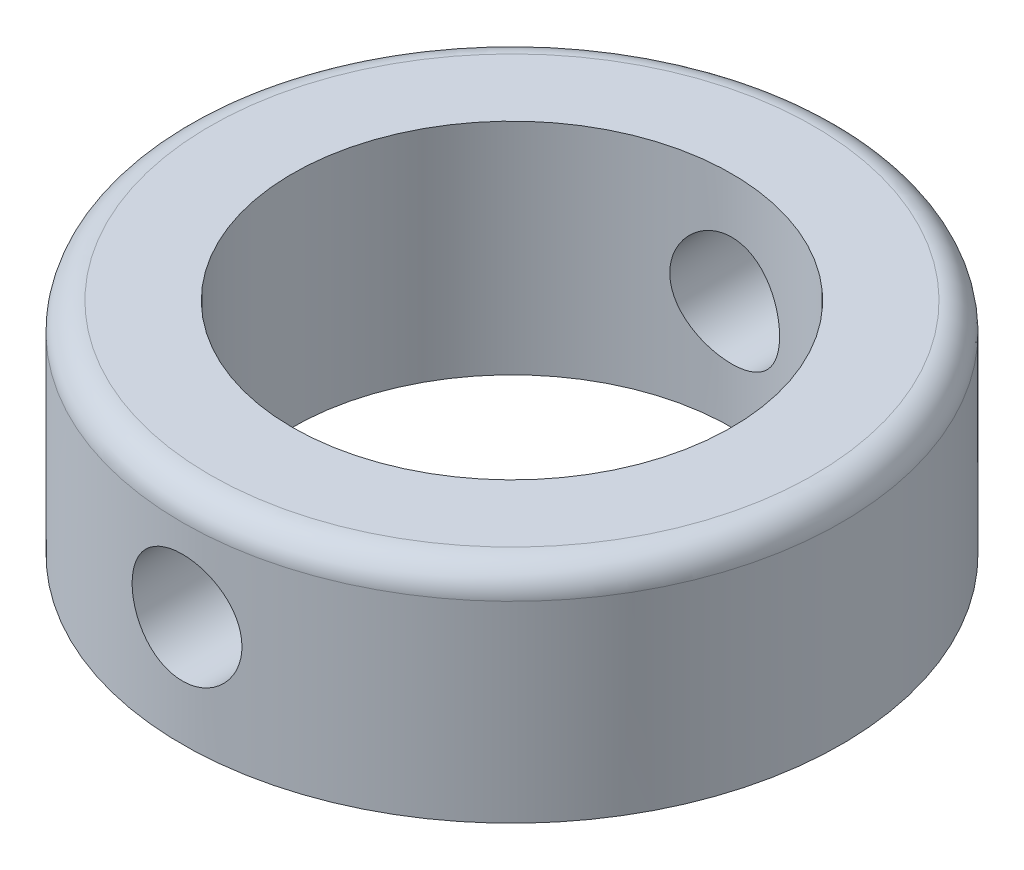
ISO-10303-21;
HEADER;
FILE_DESCRIPTION(('STEP AP214'),'2;1');
FILE_NAME('part.step','',(''),(''),'','','');
FILE_SCHEMA(('AUTOMOTIVE_DESIGN { 1 0 10303 214 1 1 1 1 }'));
ENDSEC;
DATA;
#1=APPLICATION_CONTEXT('core data for automotive mechanical design processes');
#2=APPLICATION_PROTOCOL_DEFINITION('international standard','automotive_design',2000,#1);
#3=PRODUCT_CONTEXT('',#1,'mechanical');
#4=PRODUCT('Part','Part','',(#3));
#5=PRODUCT_RELATED_PRODUCT_CATEGORY('part','',(#4));
#6=PRODUCT_DEFINITION_FORMATION('','',#4);
#7=PRODUCT_DEFINITION_CONTEXT('part definition',#1,'design');
#8=PRODUCT_DEFINITION('design','',#6,#7);
#9=PRODUCT_DEFINITION_SHAPE('','',#8);
#10=(LENGTH_UNIT() NAMED_UNIT(*) SI_UNIT(.MILLI.,.METRE.));
#11=(NAMED_UNIT(*) PLANE_ANGLE_UNIT() SI_UNIT($,.RADIAN.));
#12=(NAMED_UNIT(*) SI_UNIT($,.STERADIAN.) SOLID_ANGLE_UNIT());
#13=UNCERTAINTY_MEASURE_WITH_UNIT(LENGTH_MEASURE(1.E-05),#10,'distance_accuracy_value','');
#14=(GEOMETRIC_REPRESENTATION_CONTEXT(3) GLOBAL_UNCERTAINTY_ASSIGNED_CONTEXT((#13)) GLOBAL_UNIT_ASSIGNED_CONTEXT((#10,
#11,#12)) REPRESENTATION_CONTEXT('',''));
#15=CARTESIAN_POINT('',(0.,0.,0.));
#16=DIRECTION('',(0.,0.,1.));
#17=DIRECTION('',(1.,0.,0.));
#18=AXIS2_PLACEMENT_3D('',#15,#16,#17);
#19=CARTESIAN_POINT('',(-2.41516970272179E-06,5.98419674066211,0.));
#20=DIRECTION('',(0.,-1.,0.));
#21=DIRECTION('',(0.,0.,-1.));
#22=AXIS2_PLACEMENT_3D('',#19,#20,#21);
#23=CYLINDRICAL_SURFACE('',#22,6.);
#24=CARTESIAN_POINT('',(-2.41516970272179E-06,5.48284036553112,0.));
#25=DIRECTION('',(0.,1.,0.));
#26=DIRECTION('',(0.,0.,1.));
#27=AXIS2_PLACEMENT_3D('',#24,#25,#26);
#28=CIRCLE('',#27,6.);
#29=CARTESIAN_POINT('',(-2.41516970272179E-06,5.48284036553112,6.));
#30=VERTEX_POINT('',#29);
#31=EDGE_CURVE('E38',#30,#30,#28,.F.);
#32=ORIENTED_EDGE('',*,*,#31,.T.);
#33=EDGE_LOOP('',(#32));
#34=FACE_BOUND('',#33,.T.);
#35=CARTESIAN_POINT('',(-2.41516970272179E-06,4.9841717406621,-6.));
#36=CARTESIAN_POINT('',(0.0557539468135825,4.98416950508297,-5.99999904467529));
#37=CARTESIAN_POINT('',(0.111540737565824,4.97949283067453,-5.99921471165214));
#38=CARTESIAN_POINT('',(0.221549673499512,4.96091747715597,-5.99616137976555));
#39=CARTESIAN_POINT('',(0.275770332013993,4.94701031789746,-5.99389101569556));
#40=CARTESIAN_POINT('',(0.38103948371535,4.910405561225,-5.9881202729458));
#41=CARTESIAN_POINT('',(0.432090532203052,4.88771515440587,-5.98462090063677));
#42=CARTESIAN_POINT('',(0.529654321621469,4.83420682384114,-5.97677690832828));
#43=CARTESIAN_POINT('',(0.576167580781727,4.8033898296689,-5.97243238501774));
#44=CARTESIAN_POINT('',(0.663786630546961,4.73418970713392,-5.96333326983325));
#45=CARTESIAN_POINT('',(0.704842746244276,4.69574409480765,-5.95857548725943));
#46=CARTESIAN_POINT('',(0.779952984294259,4.61251255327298,-5.94921050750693));
#47=CARTESIAN_POINT('',(0.814006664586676,4.56772622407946,-5.94460331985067));
#48=CARTESIAN_POINT('',(0.87434443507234,4.47274335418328,-5.93603026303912));
#49=CARTESIAN_POINT('',(0.900579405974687,4.4225152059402,-5.93206851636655));
#50=CARTESIAN_POINT('',(0.944220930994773,4.31828791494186,-5.9252791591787));
#51=CARTESIAN_POINT('',(0.961628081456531,4.26428902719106,-5.92245147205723));
#52=CARTESIAN_POINT('',(0.986963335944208,4.15457963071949,-5.91828214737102));
#53=CARTESIAN_POINT('',(0.994977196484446,4.09888944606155,-5.9169270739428));
#54=CARTESIAN_POINT('',(1.00156427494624,3.98693962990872,-5.9158157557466));
#55=CARTESIAN_POINT('',(1.00013816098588,3.93068003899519,-5.91605939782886));
#56=CARTESIAN_POINT('',(0.987955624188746,3.81980059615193,-5.91810571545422));
#57=CARTESIAN_POINT('',(0.977295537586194,3.76516981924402,-5.91989229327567));
#58=CARTESIAN_POINT('',(0.947098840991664,3.65848321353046,-5.92479798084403));
#59=CARTESIAN_POINT('',(0.927561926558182,3.6064274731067,-5.92791713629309));
#60=CARTESIAN_POINT('',(0.880068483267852,3.50608021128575,-5.9351539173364));
#61=CARTESIAN_POINT('',(0.852071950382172,3.45780797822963,-5.9392762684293));
#62=CARTESIAN_POINT('',(0.788482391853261,3.36660998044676,-5.94805167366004));
#63=CARTESIAN_POINT('',(0.752888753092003,3.32368464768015,-5.95270477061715));
#64=CARTESIAN_POINT('',(0.67459046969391,3.24384130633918,-5.96208811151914));
#65=CARTESIAN_POINT('',(0.63180317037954,3.20700433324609,-5.96681859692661));
#66=CARTESIAN_POINT('',(0.540611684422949,3.14102063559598,-5.97577040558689));
#67=CARTESIAN_POINT('',(0.49220746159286,3.11187396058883,-5.97999172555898));
#68=CARTESIAN_POINT('',(0.391079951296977,3.06209084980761,-5.98745557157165));
#69=CARTESIAN_POINT('',(0.338353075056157,3.04146157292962,-5.99069727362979));
#70=CARTESIAN_POINT('',(0.230116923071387,3.00937405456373,-5.99583001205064));
#71=CARTESIAN_POINT('',(0.174607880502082,2.99791504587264,-5.9977211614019));
#72=CARTESIAN_POINT('',(0.0630815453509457,2.98460319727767,-5.99992451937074));
#73=CARTESIAN_POINT('',(0.00707787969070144,2.98263911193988,-6.00025501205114));
#74=CARTESIAN_POINT('',(-0.104458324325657,2.98807627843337,-5.99934989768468));
#75=CARTESIAN_POINT('',(-0.159990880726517,2.99547716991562,-5.99811435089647));
#76=CARTESIAN_POINT('',(-0.268664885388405,3.01934168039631,-5.99422730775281));
#77=CARTESIAN_POINT('',(-0.321818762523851,3.03575022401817,-5.99158441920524));
#78=CARTESIAN_POINT('',(-0.424621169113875,3.07710554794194,-5.98517785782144));
#79=CARTESIAN_POINT('',(-0.474269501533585,3.10205280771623,-5.98141412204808));
#80=CARTESIAN_POINT('',(-0.569134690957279,3.16003219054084,-5.97313806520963));
#81=CARTESIAN_POINT('',(-0.614308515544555,3.19313380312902,-5.96861942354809));
#82=CARTESIAN_POINT('',(-0.69849984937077,3.26638666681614,-5.9593538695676));
#83=CARTESIAN_POINT('',(-0.737516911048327,3.30653842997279,-5.95460694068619));
#84=CARTESIAN_POINT('',(-0.808699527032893,3.39325075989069,-5.94536070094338));
#85=CARTESIAN_POINT('',(-0.840789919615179,3.43987340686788,-5.94086446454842));
#86=CARTESIAN_POINT('',(-0.896683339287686,3.53791292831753,-5.93268611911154));
#87=CARTESIAN_POINT('',(-0.920486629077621,3.58932965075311,-5.92900398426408));
#88=CARTESIAN_POINT('',(-0.959017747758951,3.69528763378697,-5.92289381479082));
#89=CARTESIAN_POINT('',(-0.973782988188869,3.74981497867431,-5.92046061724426));
#90=CARTESIAN_POINT('',(-0.993936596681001,3.86061979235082,-5.91711086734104));
#91=CARTESIAN_POINT('',(-0.999325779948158,3.91689710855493,-5.91619418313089));
#92=CARTESIAN_POINT('',(-1.00055156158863,4.02885380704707,-5.91598693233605));
#93=CARTESIAN_POINT('',(-0.996506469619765,4.08453189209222,-5.9166762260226));
#94=CARTESIAN_POINT('',(-0.97923435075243,4.19440343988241,-5.91955912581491));
#95=CARTESIAN_POINT('',(-0.966007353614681,4.24859690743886,-5.92175272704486));
#96=CARTESIAN_POINT('',(-0.930792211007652,4.35391511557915,-5.92738942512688));
#97=CARTESIAN_POINT('',(-0.908814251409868,4.40504334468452,-5.93083106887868));
#98=CARTESIAN_POINT('',(-0.856733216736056,4.50290600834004,-5.93857747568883));
#99=CARTESIAN_POINT('',(-0.826629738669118,4.54964022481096,-5.9428822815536));
#100=CARTESIAN_POINT('',(-0.758729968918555,4.6379859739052,-5.95193381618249));
#101=CARTESIAN_POINT('',(-0.720846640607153,4.67953014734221,-5.95668518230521));
#102=CARTESIAN_POINT('',(-0.638646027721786,4.75571238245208,-5.96605748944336));
#103=CARTESIAN_POINT('',(-0.594327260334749,4.79034884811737,-5.97067840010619));
#104=CARTESIAN_POINT('',(-0.500150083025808,4.85195104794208,-5.97930611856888));
#105=CARTESIAN_POINT('',(-0.450255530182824,4.87886215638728,-5.98330846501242));
#106=CARTESIAN_POINT('',(-0.34660764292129,4.92387953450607,-5.9902046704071));
#107=CARTESIAN_POINT('',(-0.292858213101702,4.94199457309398,-5.99309963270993));
#108=CARTESIAN_POINT('',(-0.19908373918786,4.96497385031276,-5.99682316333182));
#109=CARTESIAN_POINT('',(-0.159625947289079,4.97216152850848,-5.99800810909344));
#110=CARTESIAN_POINT('',(-0.0801181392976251,4.9817612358,-5.99959686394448));
#111=CARTESIAN_POINT('',(-0.0400681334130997,4.98417334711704,-6.00000068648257));
#112=CARTESIAN_POINT('',(-2.41516970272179E-06,4.9841717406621,-6.));
#113=B_SPLINE_CURVE_WITH_KNOTS('',3,(#35,#36,#37,#38,#39,#40,#41,#42,#43,#44,#45,#46,#47,#48,
#49,#50,#51,#52,#53,#54,#55,#56,#57,#58,#59,#60,#61,#62,#63,#64,#65,#66,#67,#68,#69,#70,#71,#72,
#73,#74,#75,#76,#77,#78,#79,#80,#81,#82,#83,#84,#85,#86,#87,#88,#89,#90,#91,#92,#93,#94,#95,#96,
#97,#98,#99,#100,#101,#102,#103,#104,#105,#106,#107,#108,#109,#110,#111,#112),.UNSPECIFIED.,.T.,
.F.,(4,2,2,2,2,2,2,2,2,2,2,2,2,2,2,2,2,2,2,2,2,2,2,2,2,2,2,2,2,2,2,2,2,2,2,2,2,2,4),(0.,
0.167122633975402,0.334399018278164,0.501538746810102,0.668659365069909,0.837209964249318,
1.00577120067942,1.17537008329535,1.34495750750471,1.51298430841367,1.68099921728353,
1.84728208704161,2.0135706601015,2.1806582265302,2.34775928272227,2.51693107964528,
2.68610396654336,2.85541875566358,3.02471937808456,3.19203153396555,3.3593372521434,
3.52563122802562,3.69193454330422,3.85970730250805,4.02749225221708,4.19701528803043,
4.36653294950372,4.53534408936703,4.70414055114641,4.87083163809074,5.03752218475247,
5.20401927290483,5.37052462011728,5.5390055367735,5.70752533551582,5.87720892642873,
6.04672300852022,6.166816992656,6.28690890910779),.UNSPECIFIED.);
#114=CARTESIAN_POINT('',(-2.41516970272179E-06,4.9841717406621,-6.));
#115=VERTEX_POINT('',#114);
#116=EDGE_CURVE('E49',#115,#115,#113,.T.);
#117=ORIENTED_EDGE('',*,*,#116,.F.);
#118=EDGE_LOOP('',(#117));
#119=FACE_BOUND('',#118,.T.);
#120=CARTESIAN_POINT('',(0.999997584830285,3.98417174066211,5.91607978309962));
#121=CARTESIAN_POINT('',(0.999995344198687,4.03992203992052,5.91608078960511));
#122=CARTESIAN_POINT('',(0.995319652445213,4.09570278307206,5.91687637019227));
#123=CARTESIAN_POINT('',(0.976748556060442,4.20569915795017,5.91996982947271));
#124=CARTESIAN_POINT('',(0.962844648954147,4.25991329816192,5.92226909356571));
#125=CARTESIAN_POINT('',(0.926249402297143,4.36516865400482,5.9281024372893));
#126=CARTESIAN_POINT('',(0.903565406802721,4.41621248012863,5.9316354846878));
#127=CARTESIAN_POINT('',(0.850072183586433,4.51376412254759,5.93953708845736));
#128=CARTESIAN_POINT('',(0.819263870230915,4.5602724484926,5.94390555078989));
#129=CARTESIAN_POINT('',(0.750072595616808,4.64789688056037,5.95303388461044));
#130=CARTESIAN_POINT('',(0.711625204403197,4.68896179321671,5.95779686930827));
#131=CARTESIAN_POINT('',(0.628386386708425,4.76408906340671,5.96714992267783));
#132=CARTESIAN_POINT('',(0.583594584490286,4.79815100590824,5.97173998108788));
#133=CARTESIAN_POINT('',(0.488606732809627,4.85849756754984,5.98026294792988));
#134=CARTESIAN_POINT('',(0.438380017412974,4.88473454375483,5.98419176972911));
#135=CARTESIAN_POINT('',(0.334155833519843,4.92838016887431,5.99091494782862));
#136=CARTESIAN_POINT('',(0.28015861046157,4.94578939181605,5.9937093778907));
#137=CARTESIAN_POINT('',(0.170455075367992,4.97112875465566,5.99782693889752));
#138=CARTESIAN_POINT('',(0.114769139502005,4.97914490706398,5.99916341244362));
#139=CARTESIAN_POINT('',(0.00282769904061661,4.98573804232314,6.00026031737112));
#140=CARTESIAN_POINT('',(-0.0534277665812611,4.98431566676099,6.00002085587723));
#141=CARTESIAN_POINT('',(-0.164323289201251,4.97213920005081,5.99800343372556));
#142=CARTESIAN_POINT('',(-0.218973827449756,4.96147767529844,5.99624073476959));
#143=CARTESIAN_POINT('',(-0.325699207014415,4.9312713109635,5.99139191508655));
#144=CARTESIAN_POINT('',(-0.377773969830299,4.9117262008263,5.98830575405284));
#145=CARTESIAN_POINT('',(-0.478144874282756,4.86421548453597,5.98113079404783));
#146=CARTESIAN_POINT('',(-0.526422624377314,4.83621173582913,5.97703746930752));
#147=CARTESIAN_POINT('',(-0.617628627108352,4.77260661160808,5.96830295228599));
#148=CARTESIAN_POINT('',(-0.660556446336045,4.73700462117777,5.96366171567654));
#149=CARTESIAN_POINT('',(-0.74039092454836,4.65870021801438,5.95428107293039));
#150=CARTESIAN_POINT('',(-0.777218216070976,4.61591690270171,5.94954115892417));
#151=CARTESIAN_POINT('',(-0.843184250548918,4.52473690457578,5.94055183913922));
#152=CARTESIAN_POINT('',(-0.872322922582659,4.47634016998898,5.9363024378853));
#153=CARTESIAN_POINT('',(-0.922100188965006,4.37521508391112,5.92877501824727));
#154=CARTESIAN_POINT('',(-0.942729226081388,4.32248194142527,5.92549809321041));
#155=CARTESIAN_POINT('',(-0.974814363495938,4.21423211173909,5.92030475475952));
#156=CARTESIAN_POINT('',(-0.986271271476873,4.15871567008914,5.91838822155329));
#157=CARTESIAN_POINT('',(-0.999575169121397,4.04718527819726,5.91615583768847));
#158=CARTESIAN_POINT('',(-1.00153529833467,3.99118518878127,5.91582114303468));
#159=CARTESIAN_POINT('',(-0.996091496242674,3.87965707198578,5.91674013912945));
#160=CARTESIAN_POINT('',(-0.988687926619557,3.82412902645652,5.91799376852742));
#161=CARTESIAN_POINT('',(-0.96482334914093,3.71548063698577,5.92193074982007));
#162=CARTESIAN_POINT('',(-0.948419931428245,3.66234728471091,5.92460500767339));
#163=CARTESIAN_POINT('',(-0.907081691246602,3.55958367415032,5.93107429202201));
#164=CARTESIAN_POINT('',(-0.882146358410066,3.50995362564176,5.93486938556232));
#165=CARTESIAN_POINT('',(-0.824185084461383,3.41510190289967,5.94319651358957));
#166=CARTESIAN_POINT('',(-0.791086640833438,3.36992511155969,5.94773502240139));
#167=CARTESIAN_POINT('',(-0.717838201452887,3.28572632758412,5.95701866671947));
#168=CARTESIAN_POINT('',(-0.677687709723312,3.24670476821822,5.96176381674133));
#169=CARTESIAN_POINT('',(-0.590973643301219,3.17551098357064,5.97098568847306));
#170=CARTESIAN_POINT('',(-0.544347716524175,3.1434142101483,5.97545910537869));
#171=CARTESIAN_POINT('',(-0.446299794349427,3.08750960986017,5.98358044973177));
#172=CARTESIAN_POINT('',(-0.394877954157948,3.06370151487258,5.9872284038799));
#173=CARTESIAN_POINT('',(-0.28892203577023,3.02516750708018,5.99327343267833));
#174=CARTESIAN_POINT('',(-0.234402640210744,3.01040211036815,5.99567593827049));
#175=CARTESIAN_POINT('',(-0.123614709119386,2.99024550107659,5.99898233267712));
#176=CARTESIAN_POINT('',(-0.0673463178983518,2.98485351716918,5.99988634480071));
#177=CARTESIAN_POINT('',(0.044614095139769,2.98361898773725,6.0000921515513));
#178=CARTESIAN_POINT('',(0.100304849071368,2.9876616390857,5.99941320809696));
#179=CARTESIAN_POINT('',(0.210202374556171,3.00493330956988,5.99656871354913));
#180=CARTESIAN_POINT('',(0.264409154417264,3.01816227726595,5.99440317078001));
#181=CARTESIAN_POINT('',(0.369756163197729,3.05338700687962,5.98882795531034));
#182=CARTESIAN_POINT('',(0.420899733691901,3.0753730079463,5.98541966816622));
#183=CARTESIAN_POINT('',(0.518789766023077,3.12747491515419,5.97773102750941));
#184=CARTESIAN_POINT('',(0.565536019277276,3.15759120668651,5.97345063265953));
#185=CARTESIAN_POINT('',(0.653882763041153,3.22550577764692,5.96443051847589));
#186=CARTESIAN_POINT('',(0.695418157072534,3.26338812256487,5.95968609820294));
#187=CARTESIAN_POINT('',(0.771583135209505,3.3455830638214,5.95030521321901));
#188=CARTESIAN_POINT('',(0.806211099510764,3.38989716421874,5.94566877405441));
#189=CARTESIAN_POINT('',(0.867803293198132,3.48406986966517,5.93699337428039));
#190=CARTESIAN_POINT('',(0.894711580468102,3.53396547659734,5.93295887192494));
#191=CARTESIAN_POINT('',(0.93972339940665,3.63761543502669,5.92599684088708));
#192=CARTESIAN_POINT('',(0.957835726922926,3.69136586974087,5.92306820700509));
#193=CARTESIAN_POINT('',(0.980808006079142,3.78513324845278,5.91929897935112));
#194=CARTESIAN_POINT('',(0.987992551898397,3.82458246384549,5.91809849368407));
#195=CARTESIAN_POINT('',(0.997588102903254,3.90407313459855,5.91648854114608));
#196=CARTESIAN_POINT('',(0.999999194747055,3.94411457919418,5.91607905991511));
#197=CARTESIAN_POINT('',(0.999997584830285,3.98417174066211,5.91607978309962));
#198=B_SPLINE_CURVE_WITH_KNOTS('',3,(#120,#121,#122,#123,#124,#125,#126,#127,#128,#129,#130,
#131,#132,#133,#134,#135,#136,#137,#138,#139,#140,#141,#142,#143,#144,#145,#146,#147,#148,#149,
#150,#151,#152,#153,#154,#155,#156,#157,#158,#159,#160,#161,#162,#163,#164,#165,#166,#167,#168,
#169,#170,#171,#172,#173,#174,#175,#176,#177,#178,#179,#180,#181,#182,#183,#184,#185,#186,#187,
#188,#189,#190,#191,#192,#193,#194,#195,#196,#197),.UNSPECIFIED.,.T.,.F.,(4,2,2,2,2,2,2,2,2,2,2,
2,2,2,2,2,2,2,2,2,2,2,2,2,2,2,2,2,2,2,2,2,2,2,2,2,2,2,4),(0.,0.167104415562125,
0.334363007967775,0.50148199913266,0.668582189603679,0.83715663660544,1.00574107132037,
1.17533192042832,1.34491174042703,1.51292626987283,1.68092937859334,1.84726848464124,
2.0136126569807,2.18071841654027,2.34783770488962,2.51698449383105,2.68613284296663,
2.85547064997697,3.02479354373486,3.1920941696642,3.35938833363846,3.52562425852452,
3.69187012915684,3.85964937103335,4.0274404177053,4.19697645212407,4.36650700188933,
4.53529193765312,4.70406298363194,4.8707911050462,5.03751829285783,5.20406015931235,
5.37060992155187,5.53906798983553,5.70756551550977,5.87725491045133,6.04677426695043,
6.16684268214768,6.28690891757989),.UNSPECIFIED.);
#199=CARTESIAN_POINT('',(0.999997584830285,3.98417174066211,5.91607978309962));
#200=VERTEX_POINT('',#199);
#201=EDGE_CURVE('E57',#200,#200,#198,.T.);
#202=ORIENTED_EDGE('',*,*,#201,.F.);
#203=EDGE_LOOP('',(#202));
#204=FACE_BOUND('',#203,.T.);
#205=CARTESIAN_POINT('',(-2.41516970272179E-06,1.98417174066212,0.));
#206=DIRECTION('',(0.,-1.,0.));
#207=DIRECTION('',(0.,0.,-1.));
#208=AXIS2_PLACEMENT_3D('',#205,#206,#207);
#209=CIRCLE('',#208,6.);
#210=CARTESIAN_POINT('',(-2.41516970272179E-06,1.98417174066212,-6.));
#211=VERTEX_POINT('',#210);
#212=EDGE_CURVE('E42',#211,#211,#209,.T.);
#213=ORIENTED_EDGE('',*,*,#212,.F.);
#214=EDGE_LOOP('',(#213));
#215=FACE_BOUND('',#214,.T.);
#216=ADVANCED_FACE('F31',(#34,#119,#204,#215),#23,.T.);
#217=CARTESIAN_POINT('',(5.9999975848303,5.98417174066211,0.));
#218=DIRECTION('',(0.,1.,0.));
#219=DIRECTION('',(0.,0.,1.));
#220=AXIS2_PLACEMENT_3D('',#217,#218,#219);
#221=PLANE('',#220);
#222=CARTESIAN_POINT('',(-2.41516970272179E-06,5.98417174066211,0.));
#223=DIRECTION('',(0.,1.,0.));
#224=DIRECTION('',(0.,0.,1.));
#225=AXIS2_PLACEMENT_3D('',#222,#223,#224);
#226=CIRCLE('',#225,5.49866862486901);
#227=CARTESIAN_POINT('',(-2.41516970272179E-06,5.98417174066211,5.49866862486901));
#228=VERTEX_POINT('',#227);
#229=EDGE_CURVE('E10',#228,#228,#226,.T.);
#230=ORIENTED_EDGE('',*,*,#229,.T.);
#231=EDGE_LOOP('',(#230));
#232=FACE_BOUND('',#231,.T.);
#233=CARTESIAN_POINT('',(-2.41516970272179E-06,5.98417174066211,1.4656309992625E-06));
#234=DIRECTION('',(0.,1.,0.));
#235=DIRECTION('',(0.,0.,1.));
#236=AXIS2_PLACEMENT_3D('',#233,#234,#235);
#237=CIRCLE('',#236,3.99999999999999);
#238=CARTESIAN_POINT('',(-2.41516970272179E-06,5.98417174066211,4.00000146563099));
#239=VERTEX_POINT('',#238);
#240=EDGE_CURVE('E83',#239,#239,#237,.T.);
#241=ORIENTED_EDGE('',*,*,#240,.F.);
#242=EDGE_LOOP('',(#241));
#243=FACE_BOUND('',#242,.T.);
#244=ADVANCED_FACE('F97',(#232,#243),#221,.T.);
#245=CARTESIAN_POINT('',(-2.41516970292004E-06,1.98417174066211,0.));
#246=DIRECTION('',(0.,-1.,0.));
#247=DIRECTION('',(0.,0.,-1.));
#248=AXIS2_PLACEMENT_3D('',#245,#246,#247);
#249=PLANE('',#248);
#250=CARTESIAN_POINT('',(-2.41516970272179E-06,1.98417174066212,1.4656309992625E-06));
#251=DIRECTION('',(0.,1.,0.));
#252=DIRECTION('',(0.,0.,1.));
#253=AXIS2_PLACEMENT_3D('',#250,#251,#252);
#254=CIRCLE('',#253,3.99999999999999);
#255=CARTESIAN_POINT('',(-2.41516970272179E-06,1.98417174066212,4.00000146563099));
#256=VERTEX_POINT('',#255);
#257=EDGE_CURVE('E46',#256,#256,#254,.T.);
#258=ORIENTED_EDGE('',*,*,#257,.T.);
#259=EDGE_LOOP('',(#258));
#260=FACE_BOUND('',#259,.T.);
#261=ORIENTED_EDGE('',*,*,#212,.T.);
#262=EDGE_LOOP('',(#261));
#263=FACE_BOUND('',#262,.T.);
#264=ADVANCED_FACE('F89',(#260,#263),#249,.T.);
#265=CARTESIAN_POINT('',(-2.41516970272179E-06,5.98417174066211,1.4656309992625E-06));
#266=DIRECTION('',(0.,1.,0.));
#267=DIRECTION('',(0.,0.,1.));
#268=AXIS2_PLACEMENT_3D('',#265,#266,#267);
#269=CYLINDRICAL_SURFACE('',#268,3.99999999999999);
#270=CARTESIAN_POINT('',(-2.41516970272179E-06,2.98417174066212,4.00000146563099));
#271=CARTESIAN_POINT('',(0.0552483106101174,2.98417329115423,4.00000053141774));
#272=CARTESIAN_POINT('',(0.110516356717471,2.98876610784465,3.99884531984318));
#273=CARTESIAN_POINT('',(0.219468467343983,3.00698850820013,3.9943488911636));
#274=CARTESIAN_POINT('',(0.273151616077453,3.02062321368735,3.99100643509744));
#275=CARTESIAN_POINT('',(0.377344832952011,3.05646457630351,3.98250564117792));
#276=CARTESIAN_POINT('',(0.427858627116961,3.07866093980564,3.97734948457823));
#277=CARTESIAN_POINT('',(0.524445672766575,3.13095933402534,3.96577042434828));
#278=CARTESIAN_POINT('',(0.57051877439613,3.16106163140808,3.95934747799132));
#279=CARTESIAN_POINT('',(0.657865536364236,3.22897226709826,3.94578422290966));
#280=CARTESIAN_POINT('',(0.69903471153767,3.26691279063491,3.93863284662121));
#281=CARTESIAN_POINT('',(0.774496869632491,3.34913987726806,3.92449226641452));
#282=CARTESIAN_POINT('',(0.808789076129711,3.39342715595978,3.91750308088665));
#283=CARTESIAN_POINT('',(0.870015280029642,3.48790189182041,3.90436663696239));
#284=CARTESIAN_POINT('',(0.896832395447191,3.53816722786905,3.89823342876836));
#285=CARTESIAN_POINT('',(0.941595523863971,3.64267068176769,3.88766476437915));
#286=CARTESIAN_POINT('',(0.959542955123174,3.69690816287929,3.88322903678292));
#287=CARTESIAN_POINT('',(0.985700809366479,3.80666740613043,3.87667131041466));
#288=CARTESIAN_POINT('',(0.994099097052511,3.86214167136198,3.87450473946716));
#289=CARTESIAN_POINT('',(1.00150543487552,3.97375078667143,3.8725972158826));
#290=CARTESIAN_POINT('',(1.00051501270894,4.02988552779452,3.87285586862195));
#291=CARTESIAN_POINT('',(0.989321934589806,4.13978227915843,3.87572950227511));
#292=CARTESIAN_POINT('',(0.979343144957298,4.19356882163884,3.87828721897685));
#293=CARTESIAN_POINT('',(0.950813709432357,4.2986791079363,3.88537953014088));
#294=CARTESIAN_POINT('',(0.932262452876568,4.35000267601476,3.88991426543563));
#295=CARTESIAN_POINT('',(0.886923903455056,4.44933041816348,3.90050222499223));
#296=CARTESIAN_POINT('',(0.86005536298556,4.49729585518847,3.90657031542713));
#297=CARTESIAN_POINT('',(0.798901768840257,4.58811754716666,3.91953287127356));
#298=CARTESIAN_POINT('',(0.764615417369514,4.63097290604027,3.92642748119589));
#299=CARTESIAN_POINT('',(0.6884398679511,4.7116408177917,3.9405073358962));
#300=CARTESIAN_POINT('',(0.646361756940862,4.74927473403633,3.9476952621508));
#301=CARTESIAN_POINT('',(0.556405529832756,4.8169859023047,3.96137456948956));
#302=CARTESIAN_POINT('',(0.508527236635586,4.84706292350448,3.96786592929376));
#303=CARTESIAN_POINT('',(0.408074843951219,4.89887213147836,3.97945301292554));
#304=CARTESIAN_POINT('',(0.355485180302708,4.92057530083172,3.98454386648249));
#305=CARTESIAN_POINT('',(0.247248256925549,4.95478327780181,3.99272091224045));
#306=CARTESIAN_POINT('',(0.191601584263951,4.96728984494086,3.99580748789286));
#307=CARTESIAN_POINT('',(0.0803575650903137,4.98247678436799,3.99957146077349));
#308=CARTESIAN_POINT('',(0.0247953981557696,4.9854004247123,4.00030848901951));
#309=CARTESIAN_POINT('',(-0.086024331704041,4.98200573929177,3.99946016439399));
#310=CARTESIAN_POINT('',(-0.141281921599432,4.97568824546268,3.99787502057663));
#311=CARTESIAN_POINT('',(-0.249078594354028,4.95419113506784,3.9925986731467));
#312=CARTESIAN_POINT('',(-0.301645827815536,4.93914423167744,3.98893902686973));
#313=CARTESIAN_POINT('',(-0.403507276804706,4.90076701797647,3.97992617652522));
#314=CARTESIAN_POINT('',(-0.452801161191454,4.87743587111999,3.97457280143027));
#315=CARTESIAN_POINT('',(-0.547684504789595,4.82268098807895,3.96262351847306));
#316=CARTESIAN_POINT('',(-0.593192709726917,4.79112099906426,3.9560072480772));
#317=CARTESIAN_POINT('',(-0.678353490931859,4.72097846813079,3.94229819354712));
#318=CARTESIAN_POINT('',(-0.718005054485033,4.68239471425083,3.93520532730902));
#319=CARTESIAN_POINT('',(-0.791329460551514,4.59817043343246,3.92112784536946));
#320=CARTESIAN_POINT('',(-0.824831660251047,4.55237993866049,3.91415016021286));
#321=CARTESIAN_POINT('',(-0.88367625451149,4.45568331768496,3.90128732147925));
#322=CARTESIAN_POINT('',(-0.909019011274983,4.40477741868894,3.89540211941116));
#323=CARTESIAN_POINT('',(-0.950636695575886,4.29956792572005,3.88545543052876));
#324=CARTESIAN_POINT('',(-0.966965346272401,4.24528665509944,3.88138316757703));
#325=CARTESIAN_POINT('',(-0.990232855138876,4.13463198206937,3.87551309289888));
#326=CARTESIAN_POINT('',(-0.997173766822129,4.07825903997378,3.8737147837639));
#327=CARTESIAN_POINT('',(-1.00136147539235,3.96675772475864,3.87263414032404));
#328=CARTESIAN_POINT('',(-0.998881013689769,3.91164011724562,3.87328101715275));
#329=CARTESIAN_POINT('',(-0.984920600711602,3.80263581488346,3.87685419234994));
#330=CARTESIAN_POINT('',(-0.973440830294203,3.74874909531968,3.87978044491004));
#331=CARTESIAN_POINT('',(-0.941956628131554,3.64403276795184,3.88754320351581));
#332=CARTESIAN_POINT('',(-0.922003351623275,3.59318687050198,3.89236823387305));
#333=CARTESIAN_POINT('',(-0.874179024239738,3.49552815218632,3.90338650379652));
#334=CARTESIAN_POINT('',(-0.846306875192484,3.44871589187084,3.90957993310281));
#335=CARTESIAN_POINT('',(-0.782580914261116,3.35913532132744,3.92283902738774));
#336=CARTESIAN_POINT('',(-0.746537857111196,3.31650435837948,3.92992323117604));
#337=CARTESIAN_POINT('',(-0.667861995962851,3.23780704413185,3.94405498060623));
#338=CARTESIAN_POINT('',(-0.625227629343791,3.20174225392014,3.95110251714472));
#339=CARTESIAN_POINT('',(-0.533647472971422,3.13656420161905,3.96451916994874));
#340=CARTESIAN_POINT('',(-0.484601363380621,3.10758866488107,3.97087368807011));
#341=CARTESIAN_POINT('',(-0.382179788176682,3.05834009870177,3.98203429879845));
#342=CARTESIAN_POINT('',(-0.328807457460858,3.0380608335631,3.9868415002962));
#343=CARTESIAN_POINT('',(-0.229609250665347,3.00979052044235,3.99365519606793));
#344=CARTESIAN_POINT('',(-0.184255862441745,3.00020424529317,3.99601869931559));
#345=CARTESIAN_POINT('',(-0.0926064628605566,2.98739444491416,3.99919216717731));
#346=CARTESIAN_POINT('',(-0.0463105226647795,2.98417044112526,4.00000224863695));
#347=CARTESIAN_POINT('',(-2.41516970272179E-06,2.98417174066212,4.00000146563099));
#348=B_SPLINE_CURVE_WITH_KNOTS('',3,(#270,#271,#272,#273,#274,#275,#276,#277,#278,#279,#280,
#281,#282,#283,#284,#285,#286,#287,#288,#289,#290,#291,#292,#293,#294,#295,#296,#297,#298,#299,
#300,#301,#302,#303,#304,#305,#306,#307,#308,#309,#310,#311,#312,#313,#314,#315,#316,#317,#318,
#319,#320,#321,#322,#323,#324,#325,#326,#327,#328,#329,#330,#331,#332,#333,#334,#335,#336,#337,
#338,#339,#340,#341,#342,#343,#344,#345,#346,#347),.UNSPECIFIED.,.T.,.F.,(4,2,2,2,2,2,2,2,2,2,2,
2,2,2,2,2,2,2,2,2,2,2,2,2,2,2,2,2,2,2,2,2,2,2,2,2,2,2,4),(0.,0.165582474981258,
0.331258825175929,0.496736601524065,0.662219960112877,0.83076290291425,0.999324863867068,
1.1703909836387,1.34142974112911,1.50904196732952,1.67662692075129,1.84014998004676,
2.00368468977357,2.16887018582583,2.33408460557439,2.5040100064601,2.67394059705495,
2.84445486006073,3.01493649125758,3.18105539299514,3.34715934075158,3.51080183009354,
3.67446084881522,3.8410239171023,4.00761575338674,4.17829672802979,4.34897012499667,
4.51861503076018,4.68822282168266,4.85295853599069,5.01769093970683,5.18144267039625,
5.34521712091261,5.51326384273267,5.68135046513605,5.85248123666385,6.02348909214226,
6.16228161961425,6.30106370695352),.UNSPECIFIED.);
#349=CARTESIAN_POINT('',(-2.41516970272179E-06,2.98417174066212,4.00000146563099));
#350=VERTEX_POINT('',#349);
#351=EDGE_CURVE('E55',#350,#350,#348,.T.);
#352=ORIENTED_EDGE('',*,*,#351,.T.);
#353=EDGE_LOOP('',(#352));
#354=FACE_BOUND('',#353,.T.);
#355=CARTESIAN_POINT('',(0.999997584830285,3.98417174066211,-3.87298188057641));
#356=CARTESIAN_POINT('',(0.999996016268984,3.92895144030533,-3.87298293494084));
#357=CARTESIAN_POINT('',(0.995408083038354,3.87371378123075,-3.87417575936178));
#358=CARTESIAN_POINT('',(0.977206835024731,3.7648247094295,-3.87880598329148));
#359=CARTESIAN_POINT('',(0.963588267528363,3.71117423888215,-3.8822446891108));
#360=CARTESIAN_POINT('',(0.927794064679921,3.60705032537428,-3.89095343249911));
#361=CARTESIAN_POINT('',(0.905629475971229,3.55657287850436,-3.89622110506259));
#362=CARTESIAN_POINT('',(0.853406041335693,3.46004739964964,-3.90799130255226));
#363=CARTESIAN_POINT('',(0.823346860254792,3.41399955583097,-3.9144938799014));
#364=CARTESIAN_POINT('',(0.755480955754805,3.32662708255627,-3.92816139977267));
#365=CARTESIAN_POINT('',(0.717532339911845,3.28541430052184,-3.93533692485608));
#366=CARTESIAN_POINT('',(0.635270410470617,3.20986718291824,-3.94945003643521));
#367=CARTESIAN_POINT('',(0.590956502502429,3.17553349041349,-3.9563876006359));
#368=CARTESIAN_POINT('',(0.496455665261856,3.11426155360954,-3.96936019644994));
#369=CARTESIAN_POINT('',(0.446195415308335,3.08743318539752,-3.97538128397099));
#370=CARTESIAN_POINT('',(0.341702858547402,3.04264788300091,-3.9857217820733));
#371=CARTESIAN_POINT('',(0.287471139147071,3.02468963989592,-3.99004144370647));
#372=CARTESIAN_POINT('',(0.177741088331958,2.99851260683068,-3.99641756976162));
#373=CARTESIAN_POINT('',(0.122290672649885,2.99010388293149,-3.99851810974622));
#374=CARTESIAN_POINT('',(0.0107291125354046,2.9826683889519,-4.00037291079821));
#375=CARTESIAN_POINT('',(-0.0453819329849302,2.98364023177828,-4.00012751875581));
#376=CARTESIAN_POINT('',(-0.155354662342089,2.99480168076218,-3.99735091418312));
#377=CARTESIAN_POINT('',(-0.209238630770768,3.00478627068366,-3.99487054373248));
#378=CARTESIAN_POINT('',(-0.314540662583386,3.03336024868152,-3.98796188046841));
#379=CARTESIAN_POINT('',(-0.365958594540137,3.05195009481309,-3.98353348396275));
#380=CARTESIAN_POINT('',(-0.465409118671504,3.09737276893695,-3.97314857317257));
#381=CARTESIAN_POINT('',(-0.513406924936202,3.12427855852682,-3.9671786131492));
#382=CARTESIAN_POINT('',(-0.604278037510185,3.18551401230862,-3.95435814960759));
#383=CARTESIAN_POINT('',(-0.647150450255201,3.21984496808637,-3.94750749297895));
#384=CARTESIAN_POINT('',(-0.727776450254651,3.29605523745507,-3.93345338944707));
#385=CARTESIAN_POINT('',(-0.765360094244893,3.33811369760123,-3.92624541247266));
#386=CARTESIAN_POINT('',(-0.832978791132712,3.42801173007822,-3.91245870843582));
#387=CARTESIAN_POINT('',(-0.863013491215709,3.47585157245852,-3.90588001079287));
#388=CARTESIAN_POINT('',(-0.914790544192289,3.5762877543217,-3.89408052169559));
#389=CARTESIAN_POINT('',(-0.936491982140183,3.62890603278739,-3.88886646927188));
#390=CARTESIAN_POINT('',(-0.970688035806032,3.7372059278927,-3.88047309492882));
#391=CARTESIAN_POINT('',(-0.983184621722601,3.79288688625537,-3.87729333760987));
#392=CARTESIAN_POINT('',(-0.998334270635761,3.90415554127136,-3.87341995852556));
#393=CARTESIAN_POINT('',(-1.00123860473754,3.95970685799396,-3.87266289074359));
#394=CARTESIAN_POINT('',(-0.997809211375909,4.07050051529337,-3.87354790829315));
#395=CARTESIAN_POINT('',(-0.99147633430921,4.12574288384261,-3.87518977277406));
#396=CARTESIAN_POINT('',(-0.969972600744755,4.23341744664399,-3.88062686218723));
#397=CARTESIAN_POINT('',(-0.954948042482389,4.28588083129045,-3.88438641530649));
#398=CARTESIAN_POINT('',(-0.916649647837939,4.38754432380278,-3.89360140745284));
#399=CARTESIAN_POINT('',(-0.893374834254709,4.43674404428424,-3.89905704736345));
#400=CARTESIAN_POINT('',(-0.838710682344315,4.53154825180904,-3.91118308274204));
#401=CARTESIAN_POINT('',(-0.807171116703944,4.57706327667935,-3.91787520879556));
#402=CARTESIAN_POINT('',(-0.737062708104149,4.66224708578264,-3.93166686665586));
#403=CARTESIAN_POINT('',(-0.698492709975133,4.70191490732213,-3.93876646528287));
#404=CARTESIAN_POINT('',(-0.61426513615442,4.77529615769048,-3.95278814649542));
#405=CARTESIAN_POINT('',(-0.568454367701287,4.80883576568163,-3.95970134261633));
#406=CARTESIAN_POINT('',(-0.471705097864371,4.8677460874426,-3.97238740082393));
#407=CARTESIAN_POINT('',(-0.420766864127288,4.89311722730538,-3.97816032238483));
#408=CARTESIAN_POINT('',(-0.315560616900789,4.93475015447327,-3.98787899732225));
#409=CARTESIAN_POINT('',(-0.26131979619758,4.95107745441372,-3.99183785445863));
#410=CARTESIAN_POINT('',(-0.150752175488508,4.97435587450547,-3.99753970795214));
#411=CARTESIAN_POINT('',(-0.0944257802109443,4.98130880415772,-3.99928313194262));
#412=CARTESIAN_POINT('',(0.0170811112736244,4.98553933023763,-4.0003402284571));
#413=CARTESIAN_POINT('',(0.0722514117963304,4.98307344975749,-3.99971832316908));
#414=CARTESIAN_POINT('',(0.181365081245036,4.96912391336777,-3.99625749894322));
#415=CARTESIAN_POINT('',(0.235308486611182,4.957640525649,-3.99341864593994));
#416=CARTESIAN_POINT('',(0.34016862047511,4.92611952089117,-3.98585286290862));
#417=CARTESIAN_POINT('',(0.391100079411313,4.90612828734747,-3.98113617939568));
#418=CARTESIAN_POINT('',(0.48891463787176,4.85820116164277,-3.97031142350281));
#419=CARTESIAN_POINT('',(0.535797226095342,4.83026426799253,-3.96420317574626));
#420=CARTESIAN_POINT('',(0.625399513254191,4.76645650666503,-3.95107103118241));
#421=CARTESIAN_POINT('',(0.667992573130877,4.73041159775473,-3.94402870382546));
#422=CARTESIAN_POINT('',(0.746612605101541,4.65174888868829,-3.92990502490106));
#423=CARTESIAN_POINT('',(0.782637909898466,4.60912942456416,-3.92282366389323));
#424=CARTESIAN_POINT('',(0.847759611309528,4.51757032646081,-3.90927329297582));
#425=CARTESIAN_POINT('',(0.87671420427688,4.46852761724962,-3.9028181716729));
#426=CARTESIAN_POINT('',(0.925924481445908,4.36611625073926,-3.89143808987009));
#427=CARTESIAN_POINT('',(0.946186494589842,4.31275077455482,-3.88651201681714));
#428=CARTESIAN_POINT('',(0.974420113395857,4.21359472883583,-3.87951762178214));
#429=CARTESIAN_POINT('',(0.983990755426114,4.16827857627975,-3.8770851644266));
#430=CARTESIAN_POINT('',(0.996779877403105,4.07670287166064,-3.87381692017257));
#431=CARTESIAN_POINT('',(0.999998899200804,4.03044340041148,-3.87298099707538));
#432=CARTESIAN_POINT('',(0.999997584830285,3.98417174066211,-3.87298188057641));
#433=B_SPLINE_CURVE_WITH_KNOTS('',3,(#355,#356,#357,#358,#359,#360,#361,#362,#363,#364,#365,
#366,#367,#368,#369,#370,#371,#372,#373,#374,#375,#376,#377,#378,#379,#380,#381,#382,#383,#384,
#385,#386,#387,#388,#389,#390,#391,#392,#393,#394,#395,#396,#397,#398,#399,#400,#401,#402,#403,
#404,#405,#406,#407,#408,#409,#410,#411,#412,#413,#414,#415,#416,#417,#418,#419,#420,#421,#422,
#423,#424,#425,#426,#427,#428,#429,#430,#431,#432),.UNSPECIFIED.,.T.,.F.,(4,2,2,2,2,2,2,2,2,2,2,
2,2,2,2,2,2,2,2,2,2,2,2,2,2,2,2,2,2,2,2,2,2,2,2,2,2,2,4),(0.,0.165490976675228,
0.331078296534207,0.496452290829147,0.661833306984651,0.830495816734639,0.999174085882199,
1.17020598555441,1.3412126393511,1.50875500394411,1.67627259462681,1.84007305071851,
2.00388222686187,2.1691714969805,2.33448954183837,2.50428186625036,2.67408212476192,
2.84470572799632,3.0152928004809,3.18137429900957,3.34744050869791,3.51078961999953,
3.67415808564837,3.84073138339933,4.00733207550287,4.17810132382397,4.34886166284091,
4.51836829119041,4.68784219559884,4.85273378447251,5.01762046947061,5.18161950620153,
5.34563922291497,5.51358838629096,5.68158012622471,5.85270590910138,6.02370688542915,
6.16239130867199,6.30106390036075),.UNSPECIFIED.);
#434=CARTESIAN_POINT('',(0.999997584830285,3.98417174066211,-3.87298188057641));
#435=VERTEX_POINT('',#434);
#436=EDGE_CURVE('E56',#435,#435,#433,.T.);
#437=ORIENTED_EDGE('',*,*,#436,.T.);
#438=EDGE_LOOP('',(#437));
#439=FACE_BOUND('',#438,.T.);
#440=ORIENTED_EDGE('',*,*,#257,.F.);
#441=EDGE_LOOP('',(#440));
#442=FACE_BOUND('',#441,.T.);
#443=ORIENTED_EDGE('',*,*,#240,.T.);
#444=EDGE_LOOP('',(#443));
#445=FACE_BOUND('',#444,.T.);
#446=ADVANCED_FACE('F67',(#354,#439,#442,#445),#269,.F.);
#447=CARTESIAN_POINT('',(-2.41516970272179E-06,3.98417174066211,6.00001218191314));
#448=DIRECTION('',(0.,0.,1.));
#449=DIRECTION('',(1.,0.,0.));
#450=AXIS2_PLACEMENT_3D('',#447,#448,#449);
#451=CYLINDRICAL_SURFACE('',#450,0.999999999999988);
#452=ORIENTED_EDGE('',*,*,#201,.T.);
#453=EDGE_LOOP('',(#452));
#454=FACE_BOUND('',#453,.T.);
#455=ORIENTED_EDGE('',*,*,#351,.F.);
#456=EDGE_LOOP('',(#455));
#457=FACE_BOUND('',#456,.T.);
#458=ADVANCED_FACE('F62',(#454,#457),#451,.F.);
#459=ORIENTED_EDGE('',*,*,#116,.T.);
#460=EDGE_LOOP('',(#459));
#461=FACE_BOUND('',#460,.T.);
#462=ORIENTED_EDGE('',*,*,#436,.F.);
#463=EDGE_LOOP('',(#462));
#464=FACE_BOUND('',#463,.T.);
#465=ADVANCED_FACE('F66',(#461,#464),#451,.F.);
#466=CARTESIAN_POINT('',(-2.41516970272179E-06,5.48284036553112,0.));
#467=DIRECTION('',(0.,1.,0.));
#468=DIRECTION('',(0.,0.,1.));
#469=AXIS2_PLACEMENT_3D('',#466,#467,#468);
#470=TOROIDAL_SURFACE('',#469,5.49866862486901,0.501331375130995);
#471=ORIENTED_EDGE('',*,*,#229,.F.);
#472=EDGE_LOOP('',(#471));
#473=FACE_BOUND('',#472,.T.);
#474=ORIENTED_EDGE('',*,*,#31,.F.);
#475=EDGE_LOOP('',(#474));
#476=FACE_BOUND('',#475,.T.);
#477=ADVANCED_FACE('F33',(#473,#476),#470,.T.);
#478=CLOSED_SHELL('',(#216,#244,#264,#446,#458,#465,#477));
#479=MANIFOLD_SOLID_BREP('B2',#478);
#480=ADVANCED_BREP_SHAPE_REPRESENTATION('',(#18,#479),#14);
#481=SHAPE_DEFINITION_REPRESENTATION(#9,#480);
ENDSEC;
END-ISO-10303-21;
